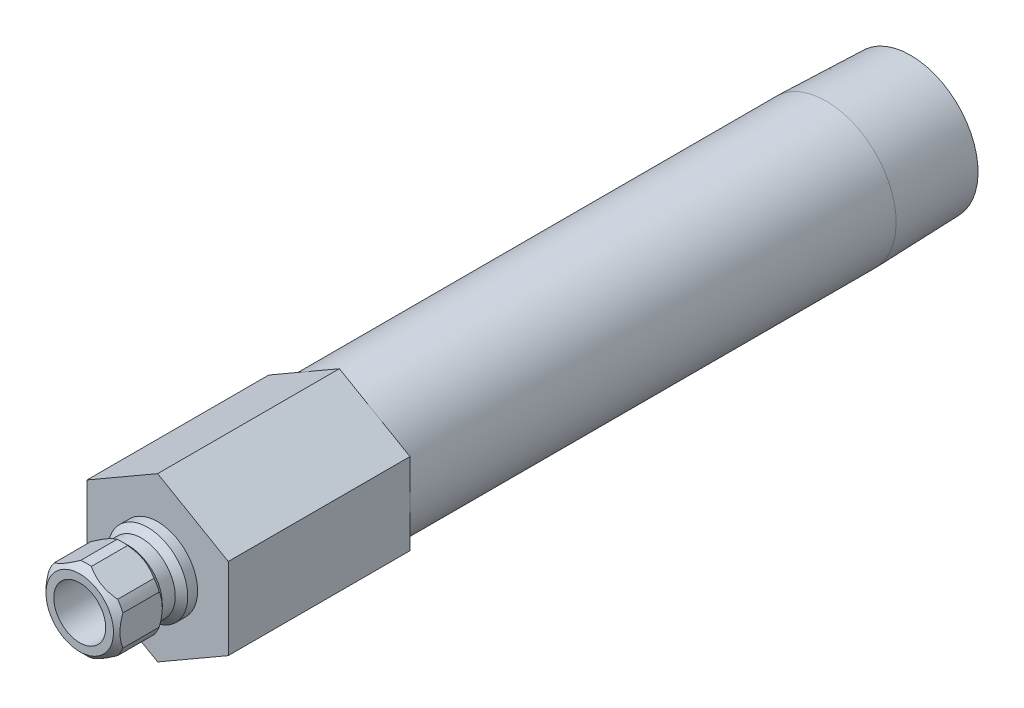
ISO-10303-21;
HEADER;
FILE_DESCRIPTION(('STEP AP214'),'2;1');
FILE_NAME('part.step','',(''),(''),'','','');
FILE_SCHEMA(('AUTOMOTIVE_DESIGN { 1 0 10303 214 1 1 1 1 }'));
ENDSEC;
DATA;
#1=APPLICATION_CONTEXT('core data for automotive mechanical design processes');
#2=APPLICATION_PROTOCOL_DEFINITION('international standard','automotive_design',2000,#1);
#3=PRODUCT_CONTEXT('',#1,'mechanical');
#4=PRODUCT('Part','Part','',(#3));
#5=PRODUCT_RELATED_PRODUCT_CATEGORY('part','',(#4));
#6=PRODUCT_DEFINITION_FORMATION('','',#4);
#7=PRODUCT_DEFINITION_CONTEXT('part definition',#1,'design');
#8=PRODUCT_DEFINITION('design','',#6,#7);
#9=PRODUCT_DEFINITION_SHAPE('','',#8);
#10=(LENGTH_UNIT() NAMED_UNIT(*) SI_UNIT(.MILLI.,.METRE.));
#11=(NAMED_UNIT(*) PLANE_ANGLE_UNIT() SI_UNIT($,.RADIAN.));
#12=(NAMED_UNIT(*) SI_UNIT($,.STERADIAN.) SOLID_ANGLE_UNIT());
#13=UNCERTAINTY_MEASURE_WITH_UNIT(LENGTH_MEASURE(1.E-05),#10,'distance_accuracy_value','');
#14=(GEOMETRIC_REPRESENTATION_CONTEXT(3) GLOBAL_UNCERTAINTY_ASSIGNED_CONTEXT((#13)) GLOBAL_UNIT_ASSIGNED_CONTEXT((#10,
#11,#12)) REPRESENTATION_CONTEXT('',''));
#15=CARTESIAN_POINT('',(0.,0.,0.));
#16=DIRECTION('',(0.,0.,1.));
#17=DIRECTION('',(1.,0.,0.));
#18=AXIS2_PLACEMENT_3D('',#15,#16,#17);
#19=CARTESIAN_POINT('',(0.,0.,0.));
#20=DIRECTION('',(0.,0.,-1.));
#21=DIRECTION('',(0.,1.,0.));
#22=AXIS2_PLACEMENT_3D('',#19,#20,#21);
#23=CYLINDRICAL_SURFACE('',#22,4.8895);
#24=DIRECTION('',(0.,0.,-1.));
#25=VECTOR('',#24,1.);
#26=CARTESIAN_POINT('',(4.5212,1.86170910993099,0.));
#27=LINE('',#26,#25);
#28=CARTESIAN_POINT('',(4.5212,1.86170910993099,4.318));
#29=VERTEX_POINT('',#28);
#30=CARTESIAN_POINT('',(4.5212,1.86170910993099,8.763));
#31=VERTEX_POINT('',#30);
#32=EDGE_CURVE('E404',#29,#31,#27,.F.);
#33=ORIENTED_EDGE('',*,*,#32,.F.);
#34=CARTESIAN_POINT('',(0.,0.,4.318));
#35=DIRECTION('',(0.,0.,-1.));
#36=DIRECTION('',(0.,1.,0.));
#37=AXIS2_PLACEMENT_3D('',#34,#35,#36);
#38=CIRCLE('',#37,4.8895);
#39=CARTESIAN_POINT('',(3.87288738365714,2.98461950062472,4.318));
#40=VERTEX_POINT('',#39);
#41=EDGE_CURVE('E206',#40,#29,#38,.T.);
#42=ORIENTED_EDGE('',*,*,#41,.F.);
#43=DIRECTION('',(0.,0.,-1.));
#44=VECTOR('',#43,1.);
#45=CARTESIAN_POINT('',(3.87288738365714,2.98461950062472,0.));
#46=LINE('',#45,#44);
#47=CARTESIAN_POINT('',(3.87288738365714,2.98461950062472,8.763));
#48=VERTEX_POINT('',#47);
#49=EDGE_CURVE('E392',#48,#40,#46,.T.);
#50=ORIENTED_EDGE('',*,*,#49,.F.);
#51=CARTESIAN_POINT('',(0.,0.,8.763));
#52=DIRECTION('',(0.,0.,-1.));
#53=DIRECTION('',(0.,1.,0.));
#54=AXIS2_PLACEMENT_3D('',#51,#52,#53);
#55=CIRCLE('',#54,4.8895);
#56=EDGE_CURVE('E193',#48,#31,#55,.T.);
#57=ORIENTED_EDGE('',*,*,#56,.T.);
#58=EDGE_LOOP('',(#33,#42,#50,#57));
#59=FACE_BOUND('',#58,.T.);
#60=ADVANCED_FACE('F34',(#59),#23,.T.);
#61=DIRECTION('',(0.,0.,-1.));
#62=VECTOR('',#61,1.);
#63=CARTESIAN_POINT('',(0.648312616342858,4.84632861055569,0.));
#64=LINE('',#63,#62);
#65=CARTESIAN_POINT('',(0.648312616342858,4.84632861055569,4.318));
#66=VERTEX_POINT('',#65);
#67=CARTESIAN_POINT('',(0.648312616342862,4.84632861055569,8.763));
#68=VERTEX_POINT('',#67);
#69=EDGE_CURVE('E311',#66,#68,#64,.F.);
#70=ORIENTED_EDGE('',*,*,#69,.F.);
#71=CARTESIAN_POINT('',(-0.648312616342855,4.84632861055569,4.318));
#72=VERTEX_POINT('',#71);
#73=EDGE_CURVE('E202',#72,#66,#38,.T.);
#74=ORIENTED_EDGE('',*,*,#73,.F.);
#75=DIRECTION('',(0.,0.,-1.));
#76=VECTOR('',#75,1.);
#77=CARTESIAN_POINT('',(-0.648312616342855,4.84632861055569,0.));
#78=LINE('',#77,#76);
#79=CARTESIAN_POINT('',(-0.648312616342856,4.84632861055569,8.763));
#80=VERTEX_POINT('',#79);
#81=EDGE_CURVE('E391',#80,#72,#78,.T.);
#82=ORIENTED_EDGE('',*,*,#81,.F.);
#83=EDGE_CURVE('E196',#80,#68,#55,.T.);
#84=ORIENTED_EDGE('',*,*,#83,.T.);
#85=EDGE_LOOP('',(#70,#74,#82,#84));
#86=FACE_BOUND('',#85,.T.);
#87=ADVANCED_FACE('F345',(#86),#23,.T.);
#88=DIRECTION('',(0.,0.,-1.));
#89=VECTOR('',#88,1.);
#90=CARTESIAN_POINT('',(-3.87288738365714,2.98461950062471,0.));
#91=LINE('',#90,#89);
#92=CARTESIAN_POINT('',(-3.87288738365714,2.98461950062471,4.318));
#93=VERTEX_POINT('',#92);
#94=CARTESIAN_POINT('',(-3.87288738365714,2.98461950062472,8.763));
#95=VERTEX_POINT('',#94);
#96=EDGE_CURVE('E54',#93,#95,#91,.F.);
#97=ORIENTED_EDGE('',*,*,#96,.F.);
#98=CARTESIAN_POINT('',(-4.5212,1.86170910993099,4.318));
#99=VERTEX_POINT('',#98);
#100=EDGE_CURVE('E205',#99,#93,#38,.T.);
#101=ORIENTED_EDGE('',*,*,#100,.F.);
#102=DIRECTION('',(0.,0.,-1.));
#103=VECTOR('',#102,1.);
#104=CARTESIAN_POINT('',(-4.5212,1.86170910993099,0.));
#105=LINE('',#104,#103);
#106=CARTESIAN_POINT('',(-4.5212,1.86170910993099,8.763));
#107=VERTEX_POINT('',#106);
#108=EDGE_CURVE('E378',#107,#99,#105,.T.);
#109=ORIENTED_EDGE('',*,*,#108,.F.);
#110=EDGE_CURVE('E195',#107,#95,#55,.T.);
#111=ORIENTED_EDGE('',*,*,#110,.T.);
#112=EDGE_LOOP('',(#97,#101,#109,#111));
#113=FACE_BOUND('',#112,.T.);
#114=ADVANCED_FACE('F350',(#113),#23,.T.);
#115=DIRECTION('',(0.,0.,-1.));
#116=VECTOR('',#115,1.);
#117=CARTESIAN_POINT('',(-4.5212,-1.86170910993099,0.));
#118=LINE('',#117,#116);
#119=CARTESIAN_POINT('',(-4.5212,-1.86170910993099,4.318));
#120=VERTEX_POINT('',#119);
#121=CARTESIAN_POINT('',(-4.5212,-1.86170910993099,8.763));
#122=VERTEX_POINT('',#121);
#123=EDGE_CURVE('E62',#120,#122,#118,.F.);
#124=ORIENTED_EDGE('',*,*,#123,.F.);
#125=CARTESIAN_POINT('',(-3.87288738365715,-2.98461950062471,4.318));
#126=VERTEX_POINT('',#125);
#127=EDGE_CURVE('E377',#126,#120,#38,.T.);
#128=ORIENTED_EDGE('',*,*,#127,.F.);
#129=DIRECTION('',(0.,0.,-1.));
#130=VECTOR('',#129,1.);
#131=CARTESIAN_POINT('',(-3.87288738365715,-2.98461950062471,0.));
#132=LINE('',#131,#130);
#133=CARTESIAN_POINT('',(-3.87288738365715,-2.98461950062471,8.763));
#134=VERTEX_POINT('',#133);
#135=EDGE_CURVE('E265',#134,#126,#132,.T.);
#136=ORIENTED_EDGE('',*,*,#135,.F.);
#137=EDGE_CURVE('E191',#134,#122,#55,.T.);
#138=ORIENTED_EDGE('',*,*,#137,.T.);
#139=EDGE_LOOP('',(#124,#128,#136,#138));
#140=FACE_BOUND('',#139,.T.);
#141=ADVANCED_FACE('F362',(#140),#23,.T.);
#142=DIRECTION('',(0.,0.,-1.));
#143=VECTOR('',#142,1.);
#144=CARTESIAN_POINT('',(-0.648312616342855,-4.84632861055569,0.));
#145=LINE('',#144,#143);
#146=CARTESIAN_POINT('',(-0.648312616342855,-4.84632861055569,4.318));
#147=VERTEX_POINT('',#146);
#148=CARTESIAN_POINT('',(-0.648312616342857,-4.84632861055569,8.763));
#149=VERTEX_POINT('',#148);
#150=EDGE_CURVE('E394',#147,#149,#145,.F.);
#151=ORIENTED_EDGE('',*,*,#150,.F.);
#152=CARTESIAN_POINT('',(0.648312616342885,-4.84632861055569,4.318));
#153=VERTEX_POINT('',#152);
#154=EDGE_CURVE('E183',#153,#147,#38,.T.);
#155=ORIENTED_EDGE('',*,*,#154,.F.);
#156=DIRECTION('',(0.,0.,-1.));
#157=VECTOR('',#156,1.);
#158=CARTESIAN_POINT('',(0.648312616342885,-4.84632861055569,0.));
#159=LINE('',#158,#157);
#160=CARTESIAN_POINT('',(0.648312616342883,-4.84632861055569,8.763));
#161=VERTEX_POINT('',#160);
#162=EDGE_CURVE('E165',#161,#153,#159,.T.);
#163=ORIENTED_EDGE('',*,*,#162,.F.);
#164=EDGE_CURVE('E181',#161,#149,#55,.T.);
#165=ORIENTED_EDGE('',*,*,#164,.T.);
#166=EDGE_LOOP('',(#151,#155,#163,#165));
#167=FACE_BOUND('',#166,.T.);
#168=ADVANCED_FACE('F180',(#167),#23,.T.);
#169=CARTESIAN_POINT('',(0.,0.,0.));
#170=DIRECTION('',(0.,0.,-1.));
#171=DIRECTION('',(0.,1.,0.));
#172=AXIS2_PLACEMENT_3D('',#169,#170,#171);
#173=CYLINDRICAL_SURFACE('',#172,8.57249999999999);
#174=CARTESIAN_POINT('',(0.,0.,-81.7372));
#175=DIRECTION('',(0.,0.,-1.));
#176=DIRECTION('',(0.,1.,0.));
#177=AXIS2_PLACEMENT_3D('',#174,#175,#176);
#178=CIRCLE('',#177,8.57249999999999);
#179=CARTESIAN_POINT('',(0.,8.5725,-81.7372));
#180=VERTEX_POINT('',#179);
#181=EDGE_CURVE('E219',#180,#180,#178,.T.);
#182=ORIENTED_EDGE('',*,*,#181,.F.);
#183=EDGE_LOOP('',(#182));
#184=FACE_BOUND('',#183,.T.);
#185=CARTESIAN_POINT('',(0.,0.,-22.225));
#186=DIRECTION('',(0.,0.,1.));
#187=DIRECTION('',(1.,0.,0.));
#188=AXIS2_PLACEMENT_3D('',#185,#186,#187);
#189=CIRCLE('',#188,8.57249999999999);
#190=CARTESIAN_POINT('',(8.57249999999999,0.,-22.225));
#191=VERTEX_POINT('',#190);
#192=EDGE_CURVE('E233',#191,#191,#189,.F.);
#193=ORIENTED_EDGE('',*,*,#192,.T.);
#194=EDGE_LOOP('',(#193));
#195=FACE_BOUND('',#194,.T.);
#196=ADVANCED_FACE('F361',(#184,#195),#173,.T.);
#197=CARTESIAN_POINT('',(0.,0.,0.));
#198=DIRECTION('',(0.,0.,-1.));
#199=DIRECTION('',(0.,1.,0.));
#200=AXIS2_PLACEMENT_3D('',#197,#198,#199);
#201=CYLINDRICAL_SURFACE('',#200,3.175);
#202=CARTESIAN_POINT('',(0.,0.,9.525));
#203=DIRECTION('',(0.,0.,-1.));
#204=DIRECTION('',(0.,1.,0.));
#205=AXIS2_PLACEMENT_3D('',#202,#203,#204);
#206=CIRCLE('',#205,3.175);
#207=CARTESIAN_POINT('',(0.,3.175,9.525));
#208=VERTEX_POINT('',#207);
#209=EDGE_CURVE('E235',#208,#208,#206,.T.);
#210=ORIENTED_EDGE('',*,*,#209,.F.);
#211=EDGE_LOOP('',(#210));
#212=FACE_BOUND('',#211,.T.);
#213=CARTESIAN_POINT('',(0.,0.,-22.225));
#214=DIRECTION('',(0.,0.,-1.));
#215=DIRECTION('',(0.,1.,0.));
#216=AXIS2_PLACEMENT_3D('',#213,#214,#215);
#217=CIRCLE('',#216,3.175);
#218=CARTESIAN_POINT('',(0.,3.175,-22.225));
#219=VERTEX_POINT('',#218);
#220=EDGE_CURVE('E174',#219,#219,#217,.T.);
#221=ORIENTED_EDGE('',*,*,#220,.T.);
#222=EDGE_LOOP('',(#221));
#223=FACE_BOUND('',#222,.T.);
#224=ADVANCED_FACE('F36',(#212,#223),#201,.F.);
#225=CARTESIAN_POINT('',(0.,3.175,-22.225));
#226=DIRECTION('',(0.,0.,-1.));
#227=DIRECTION('',(0.,1.,0.));
#228=AXIS2_PLACEMENT_3D('',#225,#226,#227);
#229=PLANE('',#228);
#230=CARTESIAN_POINT('',(0.,0.,-22.225));
#231=DIRECTION('',(0.,0.,-1.));
#232=DIRECTION('',(0.,1.,0.));
#233=AXIS2_PLACEMENT_3D('',#230,#231,#232);
#234=CIRCLE('',#233,6.2611);
#235=CARTESIAN_POINT('',(0.,6.2611,-22.225));
#236=VERTEX_POINT('',#235);
#237=EDGE_CURVE('E228',#236,#236,#234,.T.);
#238=ORIENTED_EDGE('',*,*,#237,.T.);
#239=EDGE_LOOP('',(#238));
#240=FACE_BOUND('',#239,.T.);
#241=ORIENTED_EDGE('',*,*,#220,.F.);
#242=EDGE_LOOP('',(#241));
#243=FACE_BOUND('',#242,.T.);
#244=ADVANCED_FACE('F533',(#240,#243),#229,.T.);
#245=CARTESIAN_POINT('',(0.,0.,0.));
#246=DIRECTION('',(0.,0.,-1.));
#247=DIRECTION('',(0.,1.,0.));
#248=AXIS2_PLACEMENT_3D('',#245,#246,#247);
#249=CYLINDRICAL_SURFACE('',#248,6.26109999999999);
#250=CARTESIAN_POINT('',(0.,0.,-92.075));
#251=DIRECTION('',(0.,0.,-1.));
#252=DIRECTION('',(0.,1.,0.));
#253=AXIS2_PLACEMENT_3D('',#250,#251,#252);
#254=CIRCLE('',#253,6.26109999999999);
#255=CARTESIAN_POINT('',(0.,6.2611,-92.075));
#256=VERTEX_POINT('',#255);
#257=EDGE_CURVE('E225',#256,#256,#254,.T.);
#258=ORIENTED_EDGE('',*,*,#257,.T.);
#259=EDGE_LOOP('',(#258));
#260=FACE_BOUND('',#259,.T.);
#261=ORIENTED_EDGE('',*,*,#237,.F.);
#262=EDGE_LOOP('',(#261));
#263=FACE_BOUND('',#262,.T.);
#264=ADVANCED_FACE('F530',(#260,#263),#249,.F.);
#265=CARTESIAN_POINT('',(0.,8.24944566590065,-92.075));
#266=DIRECTION('',(0.,0.,-1.));
#267=DIRECTION('',(0.,1.,0.));
#268=AXIS2_PLACEMENT_3D('',#265,#266,#267);
#269=PLANE('',#268);
#270=CARTESIAN_POINT('',(0.,0.,-92.075));
#271=DIRECTION('',(0.,0.,-1.));
#272=DIRECTION('',(0.,1.,0.));
#273=AXIS2_PLACEMENT_3D('',#270,#271,#272);
#274=CIRCLE('',#273,8.24944566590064);
#275=CARTESIAN_POINT('',(0.,8.24944566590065,-92.075));
#276=VERTEX_POINT('',#275);
#277=EDGE_CURVE('E222',#276,#276,#274,.T.);
#278=ORIENTED_EDGE('',*,*,#277,.T.);
#279=EDGE_LOOP('',(#278));
#280=FACE_BOUND('',#279,.T.);
#281=ORIENTED_EDGE('',*,*,#257,.F.);
#282=EDGE_LOOP('',(#281));
#283=FACE_BOUND('',#282,.T.);
#284=ADVANCED_FACE('F524',(#280,#283),#269,.T.);
#285=CARTESIAN_POINT('',(0.,0.,-92.075));
#286=DIRECTION('',(0.,0.,1.));
#287=DIRECTION('',(0.,-1.,0.));
#288=AXIS2_PLACEMENT_3D('',#285,#286,#287);
#289=CONICAL_SURFACE('',#288,8.24944566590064,0.0312396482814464);
#290=ORIENTED_EDGE('',*,*,#181,.T.);
#291=EDGE_LOOP('',(#290));
#292=FACE_BOUND('',#291,.T.);
#293=ORIENTED_EDGE('',*,*,#277,.F.);
#294=EDGE_LOOP('',(#293));
#295=FACE_BOUND('',#294,.T.);
#296=ADVANCED_FACE('F514',(#292,#295),#289,.T.);
#297=CARTESIAN_POINT('',(0.,4.8895,0.));
#298=DIRECTION('',(0.,0.,1.));
#299=DIRECTION('',(0.,-1.,0.));
#300=AXIS2_PLACEMENT_3D('',#297,#298,#299);
#301=PLANE('',#300);
#302=CARTESIAN_POINT('',(0.,0.,0.));
#303=DIRECTION('',(0.,0.,-1.));
#304=DIRECTION('',(0.,1.,0.));
#305=AXIS2_PLACEMENT_3D('',#302,#303,#304);
#306=CIRCLE('',#305,4.8895);
#307=CARTESIAN_POINT('',(0.,4.8895,0.));
#308=VERTEX_POINT('',#307);
#309=EDGE_CURVE('E216',#308,#308,#306,.T.);
#310=ORIENTED_EDGE('',*,*,#309,.T.);
#311=EDGE_LOOP('',(#310));
#312=FACE_BOUND('',#311,.T.);
#313=DIRECTION('',(-0.866025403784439,-0.5,0.));
#314=VECTOR('',#313,1.);
#315=CARTESIAN_POINT('',(0.,9.97199384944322,0.));
#316=LINE('',#315,#314);
#317=CARTESIAN_POINT('',(0.,9.97199384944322,0.));
#318=VERTEX_POINT('',#317);
#319=CARTESIAN_POINT('',(-8.636,4.98599692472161,0.));
#320=VERTEX_POINT('',#319);
#321=EDGE_CURVE('E409',#318,#320,#316,.T.);
#322=ORIENTED_EDGE('',*,*,#321,.T.);
#323=DIRECTION('',(0.,-1.,0.));
#324=VECTOR('',#323,1.);
#325=CARTESIAN_POINT('',(-8.636,4.98599692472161,0.));
#326=LINE('',#325,#324);
#327=CARTESIAN_POINT('',(-8.636,-4.98599692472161,0.));
#328=VERTEX_POINT('',#327);
#329=EDGE_CURVE('E436',#320,#328,#326,.T.);
#330=ORIENTED_EDGE('',*,*,#329,.T.);
#331=DIRECTION('',(0.866025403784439,-0.5,0.));
#332=VECTOR('',#331,1.);
#333=CARTESIAN_POINT('',(-8.636,-4.98599692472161,0.));
#334=LINE('',#333,#332);
#335=CARTESIAN_POINT('',(0.,-9.97199384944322,0.));
#336=VERTEX_POINT('',#335);
#337=EDGE_CURVE('E439',#328,#336,#334,.T.);
#338=ORIENTED_EDGE('',*,*,#337,.T.);
#339=DIRECTION('',(0.866025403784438,0.5,0.));
#340=VECTOR('',#339,1.);
#341=CARTESIAN_POINT('',(0.,-9.97199384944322,0.));
#342=LINE('',#341,#340);
#343=CARTESIAN_POINT('',(8.636,-4.98599692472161,0.));
#344=VERTEX_POINT('',#343);
#345=EDGE_CURVE('E442',#336,#344,#342,.T.);
#346=ORIENTED_EDGE('',*,*,#345,.T.);
#347=DIRECTION('',(0.,1.,0.));
#348=VECTOR('',#347,1.);
#349=CARTESIAN_POINT('',(8.636,-4.98599692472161,0.));
#350=LINE('',#349,#348);
#351=CARTESIAN_POINT('',(8.636,4.98599692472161,0.));
#352=VERTEX_POINT('',#351);
#353=EDGE_CURVE('E445',#344,#352,#350,.T.);
#354=ORIENTED_EDGE('',*,*,#353,.T.);
#355=DIRECTION('',(-0.866025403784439,0.5,0.));
#356=VECTOR('',#355,1.);
#357=CARTESIAN_POINT('',(8.636,4.98599692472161,0.));
#358=LINE('',#357,#356);
#359=EDGE_CURVE('E418',#352,#318,#358,.T.);
#360=ORIENTED_EDGE('',*,*,#359,.T.);
#361=EDGE_LOOP('',(#322,#330,#338,#346,#354,#360));
#362=FACE_BOUND('',#361,.T.);
#363=ADVANCED_FACE('F511',(#312,#362),#301,.T.);
#364=CARTESIAN_POINT('',(0.,0.,0.));
#365=DIRECTION('',(0.,0.,-1.));
#366=DIRECTION('',(0.,1.,0.));
#367=AXIS2_PLACEMENT_3D('',#364,#365,#366);
#368=CYLINDRICAL_SURFACE('',#367,4.8895);
#369=CARTESIAN_POINT('',(0.,0.,1.2065));
#370=DIRECTION('',(0.,0.,-1.));
#371=DIRECTION('',(0.,1.,0.));
#372=AXIS2_PLACEMENT_3D('',#369,#370,#371);
#373=CIRCLE('',#372,4.8895);
#374=CARTESIAN_POINT('',(0.,4.8895,1.2065));
#375=VERTEX_POINT('',#374);
#376=EDGE_CURVE('E213',#375,#375,#373,.T.);
#377=ORIENTED_EDGE('',*,*,#376,.T.);
#378=EDGE_LOOP('',(#377));
#379=FACE_BOUND('',#378,.T.);
#380=ORIENTED_EDGE('',*,*,#309,.F.);
#381=EDGE_LOOP('',(#380));
#382=FACE_BOUND('',#381,.T.);
#383=ADVANCED_FACE('F513',(#379,#382),#368,.T.);
#384=CARTESIAN_POINT('',(0.,0.,1.2065));
#385=DIRECTION('',(0.,0.,-1.));
#386=DIRECTION('',(0.,1.,0.));
#387=AXIS2_PLACEMENT_3D('',#384,#385,#386);
#388=CONICAL_SURFACE('',#387,4.8895,0.785398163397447);
#389=CARTESIAN_POINT('',(0.,0.,1.9685));
#390=DIRECTION('',(0.,0.,-1.));
#391=DIRECTION('',(0.,1.,0.));
#392=AXIS2_PLACEMENT_3D('',#389,#390,#391);
#393=CIRCLE('',#392,4.1275);
#394=CARTESIAN_POINT('',(0.,4.1275,1.9685));
#395=VERTEX_POINT('',#394);
#396=EDGE_CURVE('E210',#395,#395,#393,.T.);
#397=ORIENTED_EDGE('',*,*,#396,.T.);
#398=EDGE_LOOP('',(#397));
#399=FACE_BOUND('',#398,.T.);
#400=ORIENTED_EDGE('',*,*,#376,.F.);
#401=EDGE_LOOP('',(#400));
#402=FACE_BOUND('',#401,.T.);
#403=ADVANCED_FACE('F521',(#399,#402),#388,.T.);
#404=CARTESIAN_POINT('',(0.,0.,0.));
#405=DIRECTION('',(0.,0.,-1.));
#406=DIRECTION('',(0.,1.,0.));
#407=AXIS2_PLACEMENT_3D('',#404,#405,#406);
#408=CYLINDRICAL_SURFACE('',#407,4.1275);
#409=CARTESIAN_POINT('',(0.,0.,3.556));
#410=DIRECTION('',(0.,0.,-1.));
#411=DIRECTION('',(0.,1.,0.));
#412=AXIS2_PLACEMENT_3D('',#409,#410,#411);
#413=CIRCLE('',#412,4.1275);
#414=CARTESIAN_POINT('',(0.,4.1275,3.556));
#415=VERTEX_POINT('',#414);
#416=EDGE_CURVE('E207',#415,#415,#413,.T.);
#417=ORIENTED_EDGE('',*,*,#416,.T.);
#418=EDGE_LOOP('',(#417));
#419=FACE_BOUND('',#418,.T.);
#420=ORIENTED_EDGE('',*,*,#396,.F.);
#421=EDGE_LOOP('',(#420));
#422=FACE_BOUND('',#421,.T.);
#423=ADVANCED_FACE('F272',(#419,#422),#408,.T.);
#424=CARTESIAN_POINT('',(0.,0.,3.556));
#425=DIRECTION('',(0.,0.,1.));
#426=DIRECTION('',(0.,-1.,0.));
#427=AXIS2_PLACEMENT_3D('',#424,#425,#426);
#428=CONICAL_SURFACE('',#427,4.1275,0.785398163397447);
#429=CARTESIAN_POINT('',(4.52119999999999,-5.15925306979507,6.28846659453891));
#430=CARTESIAN_POINT('',(4.52119999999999,-5.03341781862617,6.19384981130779));
#431=CARTESIAN_POINT('',(4.52119999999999,-4.90687282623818,6.100161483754));
#432=CARTESIAN_POINT('',(4.52119999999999,-4.65208542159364,5.91505573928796));
#433=CARTESIAN_POINT('',(4.52119999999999,-4.52384258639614,5.8236389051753));
#434=CARTESIAN_POINT('',(4.52119999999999,-4.26444371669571,5.64284060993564));
#435=CARTESIAN_POINT('',(4.52119999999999,-4.1332728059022,5.5534804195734));
#436=CARTESIAN_POINT('',(4.52119999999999,-3.86869655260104,5.37814219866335));
#437=CARTESIAN_POINT('',(4.52119999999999,-3.73529136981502,5.29216392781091));
#438=CARTESIAN_POINT('',(4.52119999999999,-3.45835736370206,5.11964219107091));
#439=CARTESIAN_POINT('',(4.52119999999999,-3.31467977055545,5.03333631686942));
#440=CARTESIAN_POINT('',(4.52119999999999,-3.02397608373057,4.86646929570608));
#441=CARTESIAN_POINT('',(4.52119999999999,-2.87694947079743,4.78590904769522));
#442=CARTESIAN_POINT('',(4.52119999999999,-2.57957206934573,4.6322757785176));
#443=CARTESIAN_POINT('',(4.52119999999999,-2.42923274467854,4.55918074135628));
#444=CARTESIAN_POINT('',(4.52119999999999,-2.12448469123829,4.4221138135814));
#445=CARTESIAN_POINT('',(4.52119999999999,-1.97007782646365,4.35813782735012));
#446=CARTESIAN_POINT('',(4.52119999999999,-1.66898205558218,4.24604782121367));
#447=CARTESIAN_POINT('',(4.52119999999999,-1.52260919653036,4.19709368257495));
#448=CARTESIAN_POINT('',(4.52119999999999,-1.22638031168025,4.11093488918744));
#449=CARTESIAN_POINT('',(4.52119999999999,-1.07652404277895,4.07373105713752));
#450=CARTESIAN_POINT('',(4.52119999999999,-0.776693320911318,4.01362130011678));
#451=CARTESIAN_POINT('',(4.52119999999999,-0.626768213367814,3.99047322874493));
#452=CARTESIAN_POINT('',(4.52119999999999,-0.325366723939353,3.95891692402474));
#453=CARTESIAN_POINT('',(4.52119999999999,-0.173890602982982,3.95050625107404));
#454=CARTESIAN_POINT('',(4.52119999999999,0.123852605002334,3.94903068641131));
#455=CARTESIAN_POINT('',(4.52119999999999,0.270117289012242,3.95544130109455));
#456=CARTESIAN_POINT('',(4.52119999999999,0.561370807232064,3.98210770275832));
#457=CARTESIAN_POINT('',(4.5212,0.706359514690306,4.0023648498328));
#458=CARTESIAN_POINT('',(4.5212,0.996462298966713,4.05597163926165));
#459=CARTESIAN_POINT('',(4.5212,1.14153485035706,4.08954247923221));
#460=CARTESIAN_POINT('',(4.5212,1.42852462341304,4.1680002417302));
#461=CARTESIAN_POINT('',(4.5212,1.57044212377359,4.21288616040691));
#462=CARTESIAN_POINT('',(4.5212,1.86505501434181,4.31714129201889));
#463=CARTESIAN_POINT('',(4.5212,2.01739126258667,4.377515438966));
#464=CARTESIAN_POINT('',(4.5212,2.31809735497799,4.50751823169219));
#465=CARTESIAN_POINT('',(4.5212,2.46646529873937,4.57715121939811));
#466=CARTESIAN_POINT('',(4.5212,2.75996557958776,4.72401353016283));
#467=CARTESIAN_POINT('',(4.5212,2.9050858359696,4.80126680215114));
#468=CARTESIAN_POINT('',(4.5212,3.19198335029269,4.96166050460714));
#469=CARTESIAN_POINT('',(4.5212,3.33376113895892,5.04479999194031));
#470=CARTESIAN_POINT('',(4.5212,3.60742153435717,5.21154136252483));
#471=CARTESIAN_POINT('',(4.5212,3.73944496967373,5.29491333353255));
#472=CARTESIAN_POINT('',(4.5212,4.00122581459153,5.46515273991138));
#473=CARTESIAN_POINT('',(4.5212,4.13098305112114,5.55202044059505));
#474=CARTESIAN_POINT('',(4.5212,4.38747396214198,5.72790624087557));
#475=CARTESIAN_POINT('',(4.5212,4.51422365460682,5.81690106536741));
#476=CARTESIAN_POINT('',(4.5212,4.76599253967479,5.99723636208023));
#477=CARTESIAN_POINT('',(4.5212,4.89101219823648,6.08857618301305));
#478=CARTESIAN_POINT('',(4.5212,5.0153077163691,6.18087446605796));
#479=B_SPLINE_CURVE_WITH_KNOTS('',3,(#429,#430,#431,#432,#433,#434,#435,#436,#437,#438,#439,
#440,#441,#442,#443,#444,#445,#446,#447,#448,#449,#450,#451,#452,#453,#454,#455,#456,#457,#458,
#459,#460,#461,#462,#463,#464,#465,#466,#467,#468,#469,#470,#471,#472,#473,#474,#475,#476,#477,
#478),.UNSPECIFIED.,.F.,.F.,(4,2,2,2,2,2,2,2,2,2,2,2,2,2,2,2,2,2,2,2,2,2,2,2,4),(0.,
0.472324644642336,0.944769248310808,1.42087610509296,1.89694907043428,2.39966187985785,
2.90245317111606,3.40371602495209,3.90475303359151,4.36737130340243,4.83002195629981,
5.28445770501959,5.73881822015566,6.17734710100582,6.61591906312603,7.06210522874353,
7.5082518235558,7.99945943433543,8.49089821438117,8.98393391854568,9.4768908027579,
9.94525924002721,10.4136632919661,10.8782525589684,11.3427141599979),.UNSPECIFIED.);
#480=CARTESIAN_POINT('',(4.52119999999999,-1.861709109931,4.318));
#481=VERTEX_POINT('',#480);
#482=EDGE_CURVE('E407',#481,#29,#479,.T.);
#483=ORIENTED_EDGE('',*,*,#482,.F.);
#484=CARTESIAN_POINT('',(3.87288738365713,-2.98461950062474,4.318));
#485=VERTEX_POINT('',#484);
#486=EDGE_CURVE('E385',#481,#485,#38,.T.);
#487=ORIENTED_EDGE('',*,*,#486,.T.);
#488=CARTESIAN_POINT('',(0.647857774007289,-4.84659121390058,4.3182));
#489=CARTESIAN_POINT('',(0.775261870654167,-4.77303442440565,4.26213711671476));
#490=CARTESIAN_POINT('',(0.904457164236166,-4.69844348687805,4.21102627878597));
#491=CARTESIAN_POINT('',(1.16629518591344,-4.5472712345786,4.1207431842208));
#492=CARTESIAN_POINT('',(1.29894624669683,-4.47068510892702,4.08160338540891));
#493=CARTESIAN_POINT('',(1.56203676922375,-4.31878972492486,4.01877592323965));
#494=CARTESIAN_POINT('',(1.69238331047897,-4.24353411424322,3.99458163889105));
#495=CARTESIAN_POINT('',(1.95434729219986,-4.09228913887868,3.96102228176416));
#496=CARTESIAN_POINT('',(2.08596281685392,-4.01630088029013,3.95163757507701));
#497=CARTESIAN_POINT('',(2.3562305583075,-3.86026172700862,3.94821923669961));
#498=CARTESIAN_POINT('',(2.49489129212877,-3.78020591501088,3.95501290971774));
#499=CARTESIAN_POINT('',(2.7710334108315,-3.62077518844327,3.9851849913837));
#500=CARTESIAN_POINT('',(2.90851272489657,-3.5414014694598,4.00858815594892));
#501=CARTESIAN_POINT('',(3.18622016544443,-3.38106700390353,4.07155129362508));
#502=CARTESIAN_POINT('',(3.32634361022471,-3.30016669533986,4.11171074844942));
#503=CARTESIAN_POINT('',(3.60275664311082,-3.14057955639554,4.20550294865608));
#504=CARTESIAN_POINT('',(3.73905611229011,-3.06188702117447,4.25909654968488));
#505=CARTESIAN_POINT('',(3.87334222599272,-2.98435689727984,4.3182));
#506=B_SPLINE_CURVE_WITH_KNOTS('',3,(#488,#489,#490,#491,#492,#493,#494,#495,#496,#497,#498,
#499,#500,#501,#502,#503,#504,#505),.UNSPECIFIED.,.F.,.F.,(4,2,2,2,2,2,2,2,4),(0.,
0.472469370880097,0.946208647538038,1.40285320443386,1.85889185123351,2.33874707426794,
2.81931901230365,3.31879975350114,3.81684169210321),.UNSPECIFIED.);
#507=EDGE_CURVE('E258',#153,#485,#506,.T.);
#508=ORIENTED_EDGE('',*,*,#507,.F.);
#509=ORIENTED_EDGE('',*,*,#154,.T.);
#510=CARTESIAN_POINT('',(-3.87334222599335,-2.98435689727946,4.31820000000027));
#511=CARTESIAN_POINT('',(-3.74593812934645,-3.05791368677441,4.262137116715));
#512=CARTESIAN_POINT('',(-3.61674283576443,-3.13250462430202,4.21102627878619));
#513=CARTESIAN_POINT('',(-3.35490481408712,-3.2836768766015,4.12074318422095));
#514=CARTESIAN_POINT('',(-3.2222537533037,-3.36026300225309,4.08160338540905));
#515=CARTESIAN_POINT('',(-2.95916323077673,-3.51215838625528,4.01877592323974));
#516=CARTESIAN_POINT('',(-2.82881668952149,-3.58741399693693,3.99458163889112));
#517=CARTESIAN_POINT('',(-2.56685270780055,-3.73865897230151,3.96102228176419));
#518=CARTESIAN_POINT('',(-2.43523718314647,-3.81464723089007,3.95163757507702));
#519=CARTESIAN_POINT('',(-2.16496944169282,-3.97068638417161,3.94821923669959));
#520=CARTESIAN_POINT('',(-2.02630870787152,-4.05074219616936,3.9550129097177));
#521=CARTESIAN_POINT('',(-1.75016658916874,-4.21017292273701,3.98518499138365));
#522=CARTESIAN_POINT('',(-1.61268727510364,-4.2895466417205,4.00858815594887));
#523=CARTESIAN_POINT('',(-1.33497983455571,-4.44988110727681,4.07155129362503));
#524=CARTESIAN_POINT('',(-1.1948563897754,-4.5307814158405,4.11171074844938));
#525=CARTESIAN_POINT('',(-0.918443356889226,-4.69036855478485,4.20550294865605));
#526=CARTESIAN_POINT('',(-0.782143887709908,-4.76906109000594,4.25909654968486));
#527=CARTESIAN_POINT('',(-0.647857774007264,-4.84659121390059,4.3182));
#528=B_SPLINE_CURVE_WITH_KNOTS('',3,(#510,#511,#512,#513,#514,#515,#516,#517,#518,#519,#520,
#521,#522,#523,#524,#525,#526,#527),.UNSPECIFIED.,.F.,.F.,(4,2,2,2,2,2,2,2,4),(0.,
0.472469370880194,0.946208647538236,1.40285320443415,1.85889185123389,2.33874707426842,
2.81931901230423,3.31879975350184,3.81684169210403),.UNSPECIFIED.);
#529=EDGE_CURVE('E281',#126,#147,#528,.T.);
#530=ORIENTED_EDGE('',*,*,#529,.F.);
#531=ORIENTED_EDGE('',*,*,#127,.T.);
#532=CARTESIAN_POINT('',(-4.5212,-5.15925306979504,6.2884665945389));
#533=CARTESIAN_POINT('',(-4.5212,-5.03341781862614,6.19384981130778));
#534=CARTESIAN_POINT('',(-4.5212,-4.90687282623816,6.10016148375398));
#535=CARTESIAN_POINT('',(-4.5212,-4.65208542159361,5.91505573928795));
#536=CARTESIAN_POINT('',(-4.5212,-4.52384258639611,5.82363890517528));
#537=CARTESIAN_POINT('',(-4.5212,-4.26444371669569,5.64284060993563));
#538=CARTESIAN_POINT('',(-4.5212,-4.13327280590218,5.55348041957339));
#539=CARTESIAN_POINT('',(-4.5212,-3.86869655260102,5.37814219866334));
#540=CARTESIAN_POINT('',(-4.5212,-3.735291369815,5.2921639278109));
#541=CARTESIAN_POINT('',(-4.5212,-3.45835736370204,5.1196421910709));
#542=CARTESIAN_POINT('',(-4.5212,-3.31467977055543,5.03333631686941));
#543=CARTESIAN_POINT('',(-4.5212,-3.02397608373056,4.86646929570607));
#544=CARTESIAN_POINT('',(-4.5212,-2.87694947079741,4.78590904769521));
#545=CARTESIAN_POINT('',(-4.5212,-2.57957206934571,4.63227577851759));
#546=CARTESIAN_POINT('',(-4.5212,-2.42923274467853,4.55918074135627));
#547=CARTESIAN_POINT('',(-4.5212,-2.12448469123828,4.4221138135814));
#548=CARTESIAN_POINT('',(-4.5212,-1.97007782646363,4.35813782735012));
#549=CARTESIAN_POINT('',(-4.5212,-1.66898205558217,4.24604782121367));
#550=CARTESIAN_POINT('',(-4.5212,-1.52260919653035,4.19709368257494));
#551=CARTESIAN_POINT('',(-4.5212,-1.22638031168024,4.11093488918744));
#552=CARTESIAN_POINT('',(-4.5212,-1.07652404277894,4.07373105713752));
#553=CARTESIAN_POINT('',(-4.5212,-0.776693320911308,4.01362130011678));
#554=CARTESIAN_POINT('',(-4.5212,-0.626768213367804,3.99047322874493));
#555=CARTESIAN_POINT('',(-4.5212,-0.325366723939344,3.95891692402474));
#556=CARTESIAN_POINT('',(-4.5212,-0.173890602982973,3.95050625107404));
#557=CARTESIAN_POINT('',(-4.5212,0.123852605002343,3.94903068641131));
#558=CARTESIAN_POINT('',(-4.5212,0.270117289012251,3.95544130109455));
#559=CARTESIAN_POINT('',(-4.5212,0.561370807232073,3.98210770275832));
#560=CARTESIAN_POINT('',(-4.5212,0.706359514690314,4.0023648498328));
#561=CARTESIAN_POINT('',(-4.5212,0.996462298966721,4.05597163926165));
#562=CARTESIAN_POINT('',(-4.5212,1.14153485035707,4.08954247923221));
#563=CARTESIAN_POINT('',(-4.5212,1.42852462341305,4.16800024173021));
#564=CARTESIAN_POINT('',(-4.5212,1.5704421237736,4.21288616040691));
#565=CARTESIAN_POINT('',(-4.5212,1.86505501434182,4.31714129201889));
#566=CARTESIAN_POINT('',(-4.5212,2.01739126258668,4.377515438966));
#567=CARTESIAN_POINT('',(-4.5212,2.318097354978,4.50751823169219));
#568=CARTESIAN_POINT('',(-4.5212,2.46646529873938,4.57715121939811));
#569=CARTESIAN_POINT('',(-4.5212,2.75996557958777,4.72401353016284));
#570=CARTESIAN_POINT('',(-4.5212,2.9050858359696,4.80126680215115));
#571=CARTESIAN_POINT('',(-4.5212,3.1919833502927,4.96166050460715));
#572=CARTESIAN_POINT('',(-4.5212,3.33376113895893,5.04479999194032));
#573=CARTESIAN_POINT('',(-4.5212,3.60742153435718,5.21154136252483));
#574=CARTESIAN_POINT('',(-4.5212,3.73944496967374,5.29491333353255));
#575=CARTESIAN_POINT('',(-4.5212,4.00122581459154,5.46515273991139));
#576=CARTESIAN_POINT('',(-4.5212,4.13098305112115,5.55202044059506));
#577=CARTESIAN_POINT('',(-4.5212,4.38747396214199,5.72790624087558));
#578=CARTESIAN_POINT('',(-4.5212,4.51422365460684,5.81690106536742));
#579=CARTESIAN_POINT('',(-4.5212,4.76599253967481,5.99723636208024));
#580=CARTESIAN_POINT('',(-4.5212,4.89101219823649,6.08857618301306));
#581=CARTESIAN_POINT('',(-4.5212,5.01530771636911,6.18087446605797));
#582=B_SPLINE_CURVE_WITH_KNOTS('',3,(#532,#533,#534,#535,#536,#537,#538,#539,#540,#541,#542,
#543,#544,#545,#546,#547,#548,#549,#550,#551,#552,#553,#554,#555,#556,#557,#558,#559,#560,#561,
#562,#563,#564,#565,#566,#567,#568,#569,#570,#571,#572,#573,#574,#575,#576,#577,#578,#579,#580,
#581),.UNSPECIFIED.,.F.,.F.,(4,2,2,2,2,2,2,2,2,2,2,2,2,2,2,2,2,2,2,2,2,2,2,2,4),(0.,
0.472324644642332,0.944769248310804,1.42087610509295,1.89694907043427,2.39966187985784,
2.90245317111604,3.40371602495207,3.90475303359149,4.36737130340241,4.83002195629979,
5.28445770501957,5.73881822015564,6.1773471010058,6.615919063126,7.06210522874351,
7.50825182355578,7.9994594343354,8.49089821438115,8.98393391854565,9.47689080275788,
9.94525924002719,10.4136632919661,10.8782525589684,11.3427141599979),.UNSPECIFIED.);
#583=EDGE_CURVE('E288',#99,#120,#582,.F.);
#584=ORIENTED_EDGE('',*,*,#583,.F.);
#585=ORIENTED_EDGE('',*,*,#100,.T.);
#586=CARTESIAN_POINT('',(-0.647857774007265,4.84659121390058,4.3182));
#587=CARTESIAN_POINT('',(-0.775261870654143,4.77303442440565,4.26213711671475));
#588=CARTESIAN_POINT('',(-0.904457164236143,4.69844348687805,4.21102627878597));
#589=CARTESIAN_POINT('',(-1.16629518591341,4.5472712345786,4.12074318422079));
#590=CARTESIAN_POINT('',(-1.2989462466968,4.47068510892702,4.08160338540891));
#591=CARTESIAN_POINT('',(-1.56203676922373,4.31878972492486,4.01877592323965));
#592=CARTESIAN_POINT('',(-1.69238331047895,4.24353411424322,3.99458163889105));
#593=CARTESIAN_POINT('',(-1.95434729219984,4.09228913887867,3.96102228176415));
#594=CARTESIAN_POINT('',(-2.0859628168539,4.01630088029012,3.95163757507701));
#595=CARTESIAN_POINT('',(-2.35623055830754,3.86026172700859,3.9482192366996));
#596=CARTESIAN_POINT('',(-2.49489129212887,3.78020591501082,3.95501290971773));
#597=CARTESIAN_POINT('',(-2.7710334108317,3.62077518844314,3.98518499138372));
#598=CARTESIAN_POINT('',(-2.90851272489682,3.54140146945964,4.00858815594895));
#599=CARTESIAN_POINT('',(-3.18622016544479,3.38106700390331,4.07155129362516));
#600=CARTESIAN_POINT('',(-3.32634361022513,3.3001666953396,4.11171074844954));
#601=CARTESIAN_POINT('',(-3.60275664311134,3.14057955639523,4.20550294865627));
#602=CARTESIAN_POINT('',(-3.73905611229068,3.06188702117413,4.2590965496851));
#603=CARTESIAN_POINT('',(-3.87334222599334,2.98435689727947,4.31820000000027));
#604=B_SPLINE_CURVE_WITH_KNOTS('',3,(#586,#587,#588,#589,#590,#591,#592,#593,#594,#595,#596,
#597,#598,#599,#600,#601,#602,#603),.UNSPECIFIED.,.F.,.F.,(4,2,2,2,2,2,2,2,4),(0.,
0.472469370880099,0.946208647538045,1.40285320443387,1.85889185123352,2.33874707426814,
2.81931901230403,3.31879975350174,3.81684169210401),.UNSPECIFIED.);
#605=EDGE_CURVE('E295',#72,#93,#604,.T.);
#606=ORIENTED_EDGE('',*,*,#605,.F.);
#607=ORIENTED_EDGE('',*,*,#73,.T.);
#608=CARTESIAN_POINT('',(3.87334222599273,2.98435689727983,4.3182));
#609=CARTESIAN_POINT('',(3.74593812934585,3.05791368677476,4.26213711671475));
#610=CARTESIAN_POINT('',(3.61674283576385,3.13250462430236,4.21102627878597));
#611=CARTESIAN_POINT('',(3.35490481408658,3.28367687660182,4.12074318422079));
#612=CARTESIAN_POINT('',(3.22225375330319,3.3602630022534,4.08160338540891));
#613=CARTESIAN_POINT('',(2.95916323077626,3.51215838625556,4.01877592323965));
#614=CARTESIAN_POINT('',(2.82881668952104,3.58741399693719,3.99458163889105));
#615=CARTESIAN_POINT('',(2.56685270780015,3.73865897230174,3.96102228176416));
#616=CARTESIAN_POINT('',(2.4352371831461,3.81464723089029,3.95163757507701));
#617=CARTESIAN_POINT('',(2.16496944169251,3.97068638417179,3.94821923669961));
#618=CARTESIAN_POINT('',(2.02630870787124,4.05074219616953,3.95501290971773));
#619=CARTESIAN_POINT('',(1.75016658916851,4.21017292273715,3.98518499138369));
#620=CARTESIAN_POINT('',(1.61268727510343,4.28954664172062,4.00858815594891));
#621=CARTESIAN_POINT('',(1.33497983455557,4.44988110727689,4.07155129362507));
#622=CARTESIAN_POINT('',(1.19485638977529,4.53078141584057,4.11171074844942));
#623=CARTESIAN_POINT('',(0.918443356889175,4.69036855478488,4.20550294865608));
#624=CARTESIAN_POINT('',(0.782143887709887,4.76906109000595,4.25909654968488));
#625=CARTESIAN_POINT('',(0.64785777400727,4.84659121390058,4.3182));
#626=B_SPLINE_CURVE_WITH_KNOTS('',3,(#608,#609,#610,#611,#612,#613,#614,#615,#616,#617,#618,
#619,#620,#621,#622,#623,#624,#625),.UNSPECIFIED.,.F.,.F.,(4,2,2,2,2,2,2,2,4),(0.,
0.472469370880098,0.946208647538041,1.40285320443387,1.85889185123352,2.33874707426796,
2.81931901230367,3.31879975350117,3.81684169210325),.UNSPECIFIED.);
#627=EDGE_CURVE('E303',#40,#66,#626,.T.);
#628=ORIENTED_EDGE('',*,*,#627,.F.);
#629=ORIENTED_EDGE('',*,*,#41,.T.);
#630=EDGE_LOOP('',(#483,#487,#508,#509,#530,#531,#584,#585,#606,#607,#628,#629));
#631=FACE_BOUND('',#630,.T.);
#632=ORIENTED_EDGE('',*,*,#416,.F.);
#633=EDGE_LOOP('',(#632));
#634=FACE_BOUND('',#633,.T.);
#635=ADVANCED_FACE('F267',(#631,#634),#428,.T.);
#636=DIRECTION('',(0.,0.,-1.));
#637=VECTOR('',#636,1.);
#638=CARTESIAN_POINT('',(4.52119999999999,-1.861709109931,0.));
#639=LINE('',#638,#637);
#640=CARTESIAN_POINT('',(4.52119999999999,-1.861709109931,8.763));
#641=VERTEX_POINT('',#640);
#642=EDGE_CURVE('E310',#641,#481,#639,.T.);
#643=ORIENTED_EDGE('',*,*,#642,.F.);
#644=CARTESIAN_POINT('',(3.87288738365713,-2.98461950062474,8.763));
#645=VERTEX_POINT('',#644);
#646=EDGE_CURVE('E190',#641,#645,#55,.T.);
#647=ORIENTED_EDGE('',*,*,#646,.T.);
#648=DIRECTION('',(0.,0.,-1.));
#649=VECTOR('',#648,1.);
#650=CARTESIAN_POINT('',(3.87288738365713,-2.98461950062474,0.));
#651=LINE('',#650,#649);
#652=EDGE_CURVE('E168',#485,#645,#651,.F.);
#653=ORIENTED_EDGE('',*,*,#652,.F.);
#654=ORIENTED_EDGE('',*,*,#486,.F.);
#655=EDGE_LOOP('',(#643,#647,#653,#654));
#656=FACE_BOUND('',#655,.T.);
#657=ADVANCED_FACE('F271',(#656),#23,.T.);
#658=CARTESIAN_POINT('',(0.,0.,8.763));
#659=DIRECTION('',(0.,0.,-1.));
#660=DIRECTION('',(0.,1.,0.));
#661=AXIS2_PLACEMENT_3D('',#658,#659,#660);
#662=CONICAL_SURFACE('',#661,4.8895,0.785398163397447);
#663=CARTESIAN_POINT('',(4.52119999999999,-5.15925306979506,6.79253340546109));
#664=CARTESIAN_POINT('',(4.52119999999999,-5.03341781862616,6.88715018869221));
#665=CARTESIAN_POINT('',(4.52119999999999,-4.90687282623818,6.980838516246));
#666=CARTESIAN_POINT('',(4.52119999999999,-4.65208542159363,7.16594426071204));
#667=CARTESIAN_POINT('',(4.52119999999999,-4.52384258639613,7.25736109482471));
#668=CARTESIAN_POINT('',(4.52119999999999,-4.2644437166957,7.43815939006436));
#669=CARTESIAN_POINT('',(4.52119999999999,-4.1332728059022,7.5275195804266));
#670=CARTESIAN_POINT('',(4.52119999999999,-3.86869655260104,7.70285780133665));
#671=CARTESIAN_POINT('',(4.52119999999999,-3.73529136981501,7.78883607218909));
#672=CARTESIAN_POINT('',(4.52119999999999,-3.45835736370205,7.9613578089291));
#673=CARTESIAN_POINT('',(4.52119999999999,-3.31467977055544,8.04766368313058));
#674=CARTESIAN_POINT('',(4.52119999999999,-3.02397608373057,8.21453070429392));
#675=CARTESIAN_POINT('',(4.52119999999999,-2.87694947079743,8.29509095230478));
#676=CARTESIAN_POINT('',(4.52119999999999,-2.57957206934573,8.4487242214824));
#677=CARTESIAN_POINT('',(4.52119999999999,-2.42923274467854,8.52181925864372));
#678=CARTESIAN_POINT('',(4.52119999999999,-2.1244846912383,8.6588861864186));
#679=CARTESIAN_POINT('',(4.52119999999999,-1.97007782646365,8.72286217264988));
#680=CARTESIAN_POINT('',(4.52119999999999,-1.66898205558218,8.83495217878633));
#681=CARTESIAN_POINT('',(4.52119999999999,-1.52260919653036,8.88390631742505));
#682=CARTESIAN_POINT('',(4.52119999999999,-1.22638031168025,8.97006511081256));
#683=CARTESIAN_POINT('',(4.52119999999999,-1.07652404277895,9.00726894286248));
#684=CARTESIAN_POINT('',(4.52119999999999,-0.77669332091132,9.06737869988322));
#685=CARTESIAN_POINT('',(4.52119999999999,-0.626768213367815,9.09052677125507));
#686=CARTESIAN_POINT('',(4.52119999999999,-0.325366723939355,9.12208307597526));
#687=CARTESIAN_POINT('',(4.52119999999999,-0.173890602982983,9.13049374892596));
#688=CARTESIAN_POINT('',(4.52119999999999,0.123852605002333,9.13196931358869));
#689=CARTESIAN_POINT('',(4.52119999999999,0.270117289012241,9.12555869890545));
#690=CARTESIAN_POINT('',(4.52119999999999,0.561370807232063,9.09889229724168));
#691=CARTESIAN_POINT('',(4.5212,0.706359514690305,9.0786351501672));
#692=CARTESIAN_POINT('',(4.5212,0.996462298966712,9.02502836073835));
#693=CARTESIAN_POINT('',(4.5212,1.14153485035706,8.9914575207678));
#694=CARTESIAN_POINT('',(4.5212,1.42852462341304,8.91299975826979));
#695=CARTESIAN_POINT('',(4.5212,1.57044212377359,8.86811383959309));
#696=CARTESIAN_POINT('',(4.5212,1.86505501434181,8.76385870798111));
#697=CARTESIAN_POINT('',(4.5212,2.01739126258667,8.703484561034));
#698=CARTESIAN_POINT('',(4.5212,2.31809735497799,8.57348176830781));
#699=CARTESIAN_POINT('',(4.5212,2.46646529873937,8.50384878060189));
#700=CARTESIAN_POINT('',(4.5212,2.75996557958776,8.35698646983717));
#701=CARTESIAN_POINT('',(4.5212,2.90508583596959,8.27973319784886));
#702=CARTESIAN_POINT('',(4.5212,3.19198335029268,8.11933949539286));
#703=CARTESIAN_POINT('',(4.5212,3.33376113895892,8.03620000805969));
#704=CARTESIAN_POINT('',(4.5212,3.60742153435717,7.86945863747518));
#705=CARTESIAN_POINT('',(4.5212,3.73944496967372,7.78608666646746));
#706=CARTESIAN_POINT('',(4.5212,4.00122581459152,7.61584726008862));
#707=CARTESIAN_POINT('',(4.5212,4.13098305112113,7.52897955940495));
#708=CARTESIAN_POINT('',(4.5212,4.38747396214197,7.35309375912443));
#709=CARTESIAN_POINT('',(4.5212,4.51422365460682,7.2640989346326));
#710=CARTESIAN_POINT('',(4.5212,4.76599253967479,7.08376363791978));
#711=CARTESIAN_POINT('',(4.5212,4.89101219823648,6.99242381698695));
#712=CARTESIAN_POINT('',(4.5212,5.01530771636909,6.90012553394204));
#713=B_SPLINE_CURVE_WITH_KNOTS('',3,(#663,#664,#665,#666,#667,#668,#669,#670,#671,#672,#673,
#674,#675,#676,#677,#678,#679,#680,#681,#682,#683,#684,#685,#686,#687,#688,#689,#690,#691,#692,
#693,#694,#695,#696,#697,#698,#699,#700,#701,#702,#703,#704,#705,#706,#707,#708,#709,#710,#711,
#712),.UNSPECIFIED.,.F.,.F.,(4,2,2,2,2,2,2,2,2,2,2,2,2,2,2,2,2,2,2,2,2,2,2,2,4),(0.,
0.472324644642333,0.944769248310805,1.42087610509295,1.89694907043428,2.39966187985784,
2.90245317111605,3.40371602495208,3.9047530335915,4.36737130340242,4.83002195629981,
5.28445770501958,5.73881822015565,6.17734710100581,6.61591906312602,7.06210522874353,
7.5082518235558,7.99945943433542,8.49089821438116,8.98393391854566,9.47689080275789,
9.9452592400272,10.4136632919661,10.8782525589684,11.3427141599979),.UNSPECIFIED.);
#714=EDGE_CURVE('E12',#31,#641,#713,.F.);
#715=ORIENTED_EDGE('',*,*,#714,.F.);
#716=ORIENTED_EDGE('',*,*,#56,.F.);
#717=CARTESIAN_POINT('',(0.647857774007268,4.84659121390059,8.7628));
#718=CARTESIAN_POINT('',(0.775261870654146,4.77303442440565,8.81886288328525));
#719=CARTESIAN_POINT('',(0.904457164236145,4.69844348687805,8.86997372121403));
#720=CARTESIAN_POINT('',(1.16629518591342,4.5472712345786,8.96025681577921));
#721=CARTESIAN_POINT('',(1.29894624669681,4.47068510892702,8.99939661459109));
#722=CARTESIAN_POINT('',(1.56203676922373,4.31878972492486,9.06222407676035));
#723=CARTESIAN_POINT('',(1.69238331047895,4.24353411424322,9.08641836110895));
#724=CARTESIAN_POINT('',(1.95434729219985,4.09228913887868,9.11997771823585));
#725=CARTESIAN_POINT('',(2.0859628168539,4.01630088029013,9.12936242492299));
#726=CARTESIAN_POINT('',(2.35623055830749,3.86026172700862,9.1327807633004));
#727=CARTESIAN_POINT('',(2.49489129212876,3.78020591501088,9.12598709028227));
#728=CARTESIAN_POINT('',(2.77103341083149,3.62077518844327,9.09581500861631));
#729=CARTESIAN_POINT('',(2.90851272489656,3.54140146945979,9.07241184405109));
#730=CARTESIAN_POINT('',(3.18622016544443,3.38106700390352,9.00944870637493));
#731=CARTESIAN_POINT('',(3.32634361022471,3.30016669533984,8.96928925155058));
#732=CARTESIAN_POINT('',(3.60275664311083,3.14057955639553,8.87549705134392));
#733=CARTESIAN_POINT('',(3.73905611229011,3.06188702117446,8.82190345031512));
#734=CARTESIAN_POINT('',(3.87334222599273,2.98435689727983,8.7628));
#735=B_SPLINE_CURVE_WITH_KNOTS('',3,(#717,#718,#719,#720,#721,#722,#723,#724,#725,#726,#727,
#728,#729,#730,#731,#732,#733,#734),.UNSPECIFIED.,.F.,.F.,(4,2,2,2,2,2,2,2,4),(0.,
0.472469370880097,0.946208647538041,1.40285320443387,1.85889185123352,2.33874707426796,
2.81931901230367,3.31879975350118,3.81684169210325),.UNSPECIFIED.);
#736=EDGE_CURVE('E47',#68,#48,#735,.T.);
#737=ORIENTED_EDGE('',*,*,#736,.F.);
#738=ORIENTED_EDGE('',*,*,#83,.F.);
#739=CARTESIAN_POINT('',(-3.87334222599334,2.98435689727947,8.76279999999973));
#740=CARTESIAN_POINT('',(-3.74593812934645,3.05791368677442,8.81886288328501));
#741=CARTESIAN_POINT('',(-3.61674283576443,3.13250462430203,8.86997372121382));
#742=CARTESIAN_POINT('',(-3.35490481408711,3.28367687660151,8.96025681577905));
#743=CARTESIAN_POINT('',(-3.2222537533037,3.3602630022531,8.99939661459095));
#744=CARTESIAN_POINT('',(-2.95916323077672,3.51215838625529,9.06222407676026));
#745=CARTESIAN_POINT('',(-2.82881668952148,3.58741399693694,9.08641836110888));
#746=CARTESIAN_POINT('',(-2.56685270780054,3.73865897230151,9.11997771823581));
#747=CARTESIAN_POINT('',(-2.43523718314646,3.81464723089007,9.12936242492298));
#748=CARTESIAN_POINT('',(-2.16496944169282,3.97068638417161,9.13278076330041));
#749=CARTESIAN_POINT('',(-2.02630870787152,4.05074219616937,9.12598709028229));
#750=CARTESIAN_POINT('',(-1.75016658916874,4.21017292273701,9.09581500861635));
#751=CARTESIAN_POINT('',(-1.61268727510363,4.2895466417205,9.07241184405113));
#752=CARTESIAN_POINT('',(-1.33497983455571,4.44988110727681,9.00944870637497));
#753=CARTESIAN_POINT('',(-1.1948563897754,4.5307814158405,8.96928925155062));
#754=CARTESIAN_POINT('',(-0.918443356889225,4.69036855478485,8.87549705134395));
#755=CARTESIAN_POINT('',(-0.782143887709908,4.76906109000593,8.82190345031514));
#756=CARTESIAN_POINT('',(-0.647857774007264,4.84659121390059,8.7628));
#757=B_SPLINE_CURVE_WITH_KNOTS('',3,(#739,#740,#741,#742,#743,#744,#745,#746,#747,#748,#749,
#750,#751,#752,#753,#754,#755,#756),.UNSPECIFIED.,.F.,.F.,(4,2,2,2,2,2,2,2,4),(0.,
0.472469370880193,0.946208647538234,1.40285320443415,1.85889185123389,2.33874707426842,
2.81931901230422,3.31879975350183,3.81684169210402),.UNSPECIFIED.);
#758=EDGE_CURVE('E327',#95,#80,#757,.T.);
#759=ORIENTED_EDGE('',*,*,#758,.F.);
#760=ORIENTED_EDGE('',*,*,#110,.F.);
#761=CARTESIAN_POINT('',(-4.5212,-5.15925306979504,6.7925334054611));
#762=CARTESIAN_POINT('',(-4.5212,-5.03341781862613,6.88715018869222));
#763=CARTESIAN_POINT('',(-4.5212,-4.90687282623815,6.98083851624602));
#764=CARTESIAN_POINT('',(-4.5212,-4.65208542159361,7.16594426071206));
#765=CARTESIAN_POINT('',(-4.5212,-4.52384258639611,7.25736109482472));
#766=CARTESIAN_POINT('',(-4.5212,-4.26444371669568,7.43815939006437));
#767=CARTESIAN_POINT('',(-4.5212,-4.13327280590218,7.52751958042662));
#768=CARTESIAN_POINT('',(-4.5212,-3.86869655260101,7.70285780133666));
#769=CARTESIAN_POINT('',(-4.5212,-3.73529136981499,7.7888360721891));
#770=CARTESIAN_POINT('',(-4.5212,-3.45835736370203,7.9613578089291));
#771=CARTESIAN_POINT('',(-4.5212,-3.31467977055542,8.04766368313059));
#772=CARTESIAN_POINT('',(-4.5212,-3.02397608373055,8.21453070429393));
#773=CARTESIAN_POINT('',(-4.5212,-2.87694947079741,8.29509095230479));
#774=CARTESIAN_POINT('',(-4.5212,-2.57957206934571,8.44872422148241));
#775=CARTESIAN_POINT('',(-4.5212,-2.42923274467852,8.52181925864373));
#776=CARTESIAN_POINT('',(-4.5212,-2.12448469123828,8.6588861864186));
#777=CARTESIAN_POINT('',(-4.5212,-1.97007782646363,8.72286217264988));
#778=CARTESIAN_POINT('',(-4.5212,-1.66898205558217,8.83495217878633));
#779=CARTESIAN_POINT('',(-4.5212,-1.52260919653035,8.88390631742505));
#780=CARTESIAN_POINT('',(-4.5212,-1.22638031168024,8.97006511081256));
#781=CARTESIAN_POINT('',(-4.5212,-1.07652404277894,9.00726894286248));
#782=CARTESIAN_POINT('',(-4.5212,-0.776693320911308,9.06737869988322));
#783=CARTESIAN_POINT('',(-4.5212,-0.626768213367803,9.09052677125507));
#784=CARTESIAN_POINT('',(-4.5212,-0.325366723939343,9.12208307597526));
#785=CARTESIAN_POINT('',(-4.5212,-0.173890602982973,9.13049374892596));
#786=CARTESIAN_POINT('',(-4.5212,0.123852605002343,9.13196931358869));
#787=CARTESIAN_POINT('',(-4.5212,0.27011728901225,9.12555869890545));
#788=CARTESIAN_POINT('',(-4.5212,0.561370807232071,9.09889229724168));
#789=CARTESIAN_POINT('',(-4.5212,0.706359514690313,9.0786351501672));
#790=CARTESIAN_POINT('',(-4.5212,0.99646229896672,9.02502836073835));
#791=CARTESIAN_POINT('',(-4.5212,1.14153485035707,8.99145752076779));
#792=CARTESIAN_POINT('',(-4.5212,1.42852462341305,8.91299975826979));
#793=CARTESIAN_POINT('',(-4.5212,1.5704421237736,8.86811383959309));
#794=CARTESIAN_POINT('',(-4.5212,1.86505501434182,8.76385870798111));
#795=CARTESIAN_POINT('',(-4.5212,2.01739126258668,8.703484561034));
#796=CARTESIAN_POINT('',(-4.5212,2.318097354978,8.57348176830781));
#797=CARTESIAN_POINT('',(-4.5212,2.46646529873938,8.50384878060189));
#798=CARTESIAN_POINT('',(-4.5212,2.75996557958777,8.35698646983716));
#799=CARTESIAN_POINT('',(-4.5212,2.90508583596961,8.27973319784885));
#800=CARTESIAN_POINT('',(-4.5212,3.1919833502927,8.11933949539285));
#801=CARTESIAN_POINT('',(-4.5212,3.33376113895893,8.03620000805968));
#802=CARTESIAN_POINT('',(-4.5212,3.60742153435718,7.86945863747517));
#803=CARTESIAN_POINT('',(-4.5212,3.73944496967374,7.78608666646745));
#804=CARTESIAN_POINT('',(-4.5212,4.00122581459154,7.61584726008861));
#805=CARTESIAN_POINT('',(-4.5212,4.13098305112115,7.52897955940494));
#806=CARTESIAN_POINT('',(-4.5212,4.38747396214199,7.35309375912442));
#807=CARTESIAN_POINT('',(-4.5212,4.51422365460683,7.26409893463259));
#808=CARTESIAN_POINT('',(-4.5212,4.7659925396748,7.08376363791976));
#809=CARTESIAN_POINT('',(-4.5212,4.89101219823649,6.99242381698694));
#810=CARTESIAN_POINT('',(-4.5212,5.01530771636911,6.90012553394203));
#811=B_SPLINE_CURVE_WITH_KNOTS('',3,(#761,#762,#763,#764,#765,#766,#767,#768,#769,#770,#771,
#772,#773,#774,#775,#776,#777,#778,#779,#780,#781,#782,#783,#784,#785,#786,#787,#788,#789,#790,
#791,#792,#793,#794,#795,#796,#797,#798,#799,#800,#801,#802,#803,#804,#805,#806,#807,#808,#809,
#810),.UNSPECIFIED.,.F.,.F.,(4,2,2,2,2,2,2,2,2,2,2,2,2,2,2,2,2,2,2,2,2,2,2,2,4),(0.,
0.472324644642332,0.944769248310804,1.42087610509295,1.89694907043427,2.39966187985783,
2.90245317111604,3.40371602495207,3.90475303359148,4.3673713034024,4.83002195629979,
5.28445770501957,5.73881822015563,6.17734710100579,6.61591906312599,7.0621052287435,
7.50825182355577,7.9994594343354,8.49089821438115,8.98393391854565,9.47689080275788,
9.94525924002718,10.4136632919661,10.8782525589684,11.3427141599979),.UNSPECIFIED.);
#812=EDGE_CURVE('E331',#122,#107,#811,.T.);
#813=ORIENTED_EDGE('',*,*,#812,.F.);
#814=ORIENTED_EDGE('',*,*,#137,.F.);
#815=CARTESIAN_POINT('',(-0.647857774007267,-4.84659121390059,8.7628));
#816=CARTESIAN_POINT('',(-0.775261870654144,-4.77303442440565,8.81886288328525));
#817=CARTESIAN_POINT('',(-0.904457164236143,-4.69844348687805,8.86997372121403));
#818=CARTESIAN_POINT('',(-1.16629518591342,-4.5472712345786,8.96025681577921));
#819=CARTESIAN_POINT('',(-1.29894624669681,-4.47068510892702,8.99939661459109));
#820=CARTESIAN_POINT('',(-1.56203676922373,-4.31878972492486,9.06222407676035));
#821=CARTESIAN_POINT('',(-1.69238331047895,-4.24353411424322,9.08641836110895));
#822=CARTESIAN_POINT('',(-1.95434729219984,-4.09228913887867,9.11997771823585));
#823=CARTESIAN_POINT('',(-2.0859628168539,-4.01630088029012,9.12936242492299));
#824=CARTESIAN_POINT('',(-2.35623055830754,-3.86026172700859,9.1327807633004));
#825=CARTESIAN_POINT('',(-2.49489129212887,-3.78020591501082,9.12598709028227));
#826=CARTESIAN_POINT('',(-2.7710334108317,-3.62077518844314,9.09581500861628));
#827=CARTESIAN_POINT('',(-2.90851272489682,-3.54140146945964,9.07241184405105));
#828=CARTESIAN_POINT('',(-3.18622016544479,-3.3810670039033,9.00944870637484));
#829=CARTESIAN_POINT('',(-3.32634361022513,-3.3001666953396,8.96928925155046));
#830=CARTESIAN_POINT('',(-3.60275664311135,-3.14057955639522,8.87549705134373));
#831=CARTESIAN_POINT('',(-3.73905611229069,-3.06188702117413,8.8219034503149));
#832=CARTESIAN_POINT('',(-3.87334222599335,-2.98435689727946,8.76279999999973));
#833=B_SPLINE_CURVE_WITH_KNOTS('',3,(#815,#816,#817,#818,#819,#820,#821,#822,#823,#824,#825,
#826,#827,#828,#829,#830,#831,#832),.UNSPECIFIED.,.F.,.F.,(4,2,2,2,2,2,2,2,4),(0.,
0.472469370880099,0.946208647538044,1.40285320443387,1.85889185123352,2.33874707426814,
2.81931901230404,3.31879975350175,3.81684169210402),.UNSPECIFIED.);
#834=EDGE_CURVE('E173',#149,#134,#833,.T.);
#835=ORIENTED_EDGE('',*,*,#834,.F.);
#836=ORIENTED_EDGE('',*,*,#164,.F.);
#837=CARTESIAN_POINT('',(3.87334222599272,-2.98435689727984,8.7628));
#838=CARTESIAN_POINT('',(3.74593812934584,-3.05791368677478,8.81886288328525));
#839=CARTESIAN_POINT('',(3.61674283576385,-3.13250462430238,8.86997372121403));
#840=CARTESIAN_POINT('',(3.35490481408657,-3.28367687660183,8.9602568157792));
#841=CARTESIAN_POINT('',(3.22225375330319,-3.36026300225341,8.99939661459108));
#842=CARTESIAN_POINT('',(2.95916323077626,-3.51215838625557,9.06222407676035));
#843=CARTESIAN_POINT('',(2.82881668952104,-3.5874139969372,9.08641836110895));
#844=CARTESIAN_POINT('',(2.56685270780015,-3.73865897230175,9.11997771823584));
#845=CARTESIAN_POINT('',(2.4352371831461,-3.8146472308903,9.12936242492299));
#846=CARTESIAN_POINT('',(2.16496944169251,-3.9706863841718,9.13278076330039));
#847=CARTESIAN_POINT('',(2.02630870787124,-4.05074219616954,9.12598709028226));
#848=CARTESIAN_POINT('',(1.75016658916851,-4.21017292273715,9.0958150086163));
#849=CARTESIAN_POINT('',(1.61268727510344,-4.28954664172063,9.07241184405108));
#850=CARTESIAN_POINT('',(1.33497983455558,-4.4498811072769,9.00944870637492));
#851=CARTESIAN_POINT('',(1.1948563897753,-4.53078141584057,8.96928925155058));
#852=CARTESIAN_POINT('',(0.918443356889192,-4.69036855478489,8.87549705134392));
#853=CARTESIAN_POINT('',(0.782143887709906,-4.76906109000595,8.82190345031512));
#854=CARTESIAN_POINT('',(0.647857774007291,-4.84659121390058,8.7628));
#855=B_SPLINE_CURVE_WITH_KNOTS('',3,(#837,#838,#839,#840,#841,#842,#843,#844,#845,#846,#847,
#848,#849,#850,#851,#852,#853,#854),.UNSPECIFIED.,.F.,.F.,(4,2,2,2,2,2,2,2,4),(0.,
0.472469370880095,0.946208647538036,1.40285320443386,1.85889185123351,2.33874707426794,
2.81931901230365,3.31879975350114,3.81684169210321),.UNSPECIFIED.);
#856=EDGE_CURVE('E162',#645,#161,#855,.T.);
#857=ORIENTED_EDGE('',*,*,#856,.F.);
#858=ORIENTED_EDGE('',*,*,#646,.F.);
#859=EDGE_LOOP('',(#715,#716,#737,#738,#759,#760,#813,#814,#835,#836,#857,#858));
#860=FACE_BOUND('',#859,.T.);
#861=CARTESIAN_POINT('',(0.,0.,9.525));
#862=DIRECTION('',(0.,0.,-1.));
#863=DIRECTION('',(0.,1.,0.));
#864=AXIS2_PLACEMENT_3D('',#861,#862,#863);
#865=CIRCLE('',#864,4.1275);
#866=CARTESIAN_POINT('',(0.,4.1275,9.525));
#867=VERTEX_POINT('',#866);
#868=EDGE_CURVE('E200',#867,#867,#865,.T.);
#869=ORIENTED_EDGE('',*,*,#868,.T.);
#870=EDGE_LOOP('',(#869));
#871=FACE_BOUND('',#870,.T.);
#872=ADVANCED_FACE('F187',(#860,#871),#662,.T.);
#873=CARTESIAN_POINT('',(0.,3.175,9.525));
#874=DIRECTION('',(0.,0.,1.));
#875=DIRECTION('',(0.,-1.,0.));
#876=AXIS2_PLACEMENT_3D('',#873,#874,#875);
#877=PLANE('',#876);
#878=ORIENTED_EDGE('',*,*,#209,.T.);
#879=EDGE_LOOP('',(#878));
#880=FACE_BOUND('',#879,.T.);
#881=ORIENTED_EDGE('',*,*,#868,.F.);
#882=EDGE_LOOP('',(#881));
#883=FACE_BOUND('',#882,.T.);
#884=ADVANCED_FACE('F358',(#880,#883),#877,.T.);
#885=CARTESIAN_POINT('',(0.,9.97199384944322,-22.225));
#886=DIRECTION('',(-0.5,0.866025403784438,0.));
#887=DIRECTION('',(-0.866025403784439,-0.5,0.));
#888=AXIS2_PLACEMENT_3D('',#885,#886,#887);
#889=PLANE('',#888);
#890=ORIENTED_EDGE('',*,*,#321,.F.);
#891=DIRECTION('',(0.,0.,1.));
#892=VECTOR('',#891,1.);
#893=CARTESIAN_POINT('',(0.,9.97199384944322,-22.225));
#894=LINE('',#893,#892);
#895=CARTESIAN_POINT('',(0.,9.97199384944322,-22.225));
#896=VERTEX_POINT('',#895);
#897=EDGE_CURVE('E236',#896,#318,#894,.T.);
#898=ORIENTED_EDGE('',*,*,#897,.F.);
#899=DIRECTION('',(-0.866025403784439,-0.5,0.));
#900=VECTOR('',#899,1.);
#901=CARTESIAN_POINT('',(0.,9.97199384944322,-22.225));
#902=LINE('',#901,#900);
#903=CARTESIAN_POINT('',(-8.636,4.98599692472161,-22.225));
#904=VERTEX_POINT('',#903);
#905=EDGE_CURVE('E414',#896,#904,#902,.T.);
#906=ORIENTED_EDGE('',*,*,#905,.T.);
#907=DIRECTION('',(0.,0.,1.));
#908=VECTOR('',#907,1.);
#909=CARTESIAN_POINT('',(-8.636,4.98599692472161,-22.225));
#910=LINE('',#909,#908);
#911=EDGE_CURVE('E433',#904,#320,#910,.T.);
#912=ORIENTED_EDGE('',*,*,#911,.T.);
#913=EDGE_LOOP('',(#890,#898,#906,#912));
#914=FACE_BOUND('',#913,.T.);
#915=ADVANCED_FACE('F466',(#914),#889,.T.);
#916=CARTESIAN_POINT('',(8.636,4.98599692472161,-22.225));
#917=DIRECTION('',(0.5,0.866025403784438,0.));
#918=DIRECTION('',(-0.866025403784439,0.5,0.));
#919=AXIS2_PLACEMENT_3D('',#916,#917,#918);
#920=PLANE('',#919);
#921=ORIENTED_EDGE('',*,*,#359,.F.);
#922=DIRECTION('',(0.,0.,1.));
#923=VECTOR('',#922,1.);
#924=CARTESIAN_POINT('',(8.636,4.98599692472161,-22.225));
#925=LINE('',#924,#923);
#926=CARTESIAN_POINT('',(8.636,4.98599692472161,-22.225));
#927=VERTEX_POINT('',#926);
#928=EDGE_CURVE('E451',#927,#352,#925,.T.);
#929=ORIENTED_EDGE('',*,*,#928,.F.);
#930=DIRECTION('',(-0.866025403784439,0.5,0.));
#931=VECTOR('',#930,1.);
#932=CARTESIAN_POINT('',(8.636,4.98599692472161,-22.225));
#933=LINE('',#932,#931);
#934=EDGE_CURVE('E430',#927,#896,#933,.T.);
#935=ORIENTED_EDGE('',*,*,#934,.T.);
#936=ORIENTED_EDGE('',*,*,#897,.T.);
#937=EDGE_LOOP('',(#921,#929,#935,#936));
#938=FACE_BOUND('',#937,.T.);
#939=ADVANCED_FACE('F470',(#938),#920,.T.);
#940=CARTESIAN_POINT('',(8.636,-4.98599692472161,-22.225));
#941=DIRECTION('',(1.,0.,0.));
#942=DIRECTION('',(0.,1.,0.));
#943=AXIS2_PLACEMENT_3D('',#940,#941,#942);
#944=PLANE('',#943);
#945=ORIENTED_EDGE('',*,*,#353,.F.);
#946=DIRECTION('',(0.,0.,1.));
#947=VECTOR('',#946,1.);
#948=CARTESIAN_POINT('',(8.636,-4.98599692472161,-22.225));
#949=LINE('',#948,#947);
#950=CARTESIAN_POINT('',(8.636,-4.98599692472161,-22.225));
#951=VERTEX_POINT('',#950);
#952=EDGE_CURVE('E453',#951,#344,#949,.T.);
#953=ORIENTED_EDGE('',*,*,#952,.F.);
#954=DIRECTION('',(0.,1.,0.));
#955=VECTOR('',#954,1.);
#956=CARTESIAN_POINT('',(8.636,-4.98599692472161,-22.225));
#957=LINE('',#956,#955);
#958=EDGE_CURVE('E427',#951,#927,#957,.T.);
#959=ORIENTED_EDGE('',*,*,#958,.T.);
#960=ORIENTED_EDGE('',*,*,#928,.T.);
#961=EDGE_LOOP('',(#945,#953,#959,#960));
#962=FACE_BOUND('',#961,.T.);
#963=ADVANCED_FACE('F485',(#962),#944,.T.);
#964=CARTESIAN_POINT('',(0.,-9.97199384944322,-22.225));
#965=DIRECTION('',(0.5,-0.866025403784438,0.));
#966=DIRECTION('',(0.866025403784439,0.5,0.));
#967=AXIS2_PLACEMENT_3D('',#964,#965,#966);
#968=PLANE('',#967);
#969=ORIENTED_EDGE('',*,*,#345,.F.);
#970=DIRECTION('',(0.,0.,1.));
#971=VECTOR('',#970,1.);
#972=CARTESIAN_POINT('',(0.,-9.97199384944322,-22.225));
#973=LINE('',#972,#971);
#974=CARTESIAN_POINT('',(0.,-9.97199384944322,-22.225));
#975=VERTEX_POINT('',#974);
#976=EDGE_CURVE('E455',#975,#336,#973,.T.);
#977=ORIENTED_EDGE('',*,*,#976,.F.);
#978=DIRECTION('',(0.866025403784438,0.5,0.));
#979=VECTOR('',#978,1.);
#980=CARTESIAN_POINT('',(0.,-9.97199384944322,-22.225));
#981=LINE('',#980,#979);
#982=EDGE_CURVE('E424',#975,#951,#981,.T.);
#983=ORIENTED_EDGE('',*,*,#982,.T.);
#984=ORIENTED_EDGE('',*,*,#952,.T.);
#985=EDGE_LOOP('',(#969,#977,#983,#984));
#986=FACE_BOUND('',#985,.T.);
#987=ADVANCED_FACE('F481',(#986),#968,.T.);
#988=CARTESIAN_POINT('',(-8.636,-4.98599692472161,-22.225));
#989=DIRECTION('',(-0.5,-0.866025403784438,0.));
#990=DIRECTION('',(0.866025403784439,-0.5,0.));
#991=AXIS2_PLACEMENT_3D('',#988,#989,#990);
#992=PLANE('',#991);
#993=ORIENTED_EDGE('',*,*,#337,.F.);
#994=DIRECTION('',(0.,0.,1.));
#995=VECTOR('',#994,1.);
#996=CARTESIAN_POINT('',(-8.636,-4.98599692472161,-22.225));
#997=LINE('',#996,#995);
#998=CARTESIAN_POINT('',(-8.636,-4.98599692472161,-22.225));
#999=VERTEX_POINT('',#998);
#1000=EDGE_CURVE('E457',#999,#328,#997,.T.);
#1001=ORIENTED_EDGE('',*,*,#1000,.F.);
#1002=DIRECTION('',(0.866025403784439,-0.5,0.));
#1003=VECTOR('',#1002,1.);
#1004=CARTESIAN_POINT('',(-8.636,-4.98599692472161,-22.225));
#1005=LINE('',#1004,#1003);
#1006=EDGE_CURVE('E421',#999,#975,#1005,.T.);
#1007=ORIENTED_EDGE('',*,*,#1006,.T.);
#1008=ORIENTED_EDGE('',*,*,#976,.T.);
#1009=EDGE_LOOP('',(#993,#1001,#1007,#1008));
#1010=FACE_BOUND('',#1009,.T.);
#1011=ADVANCED_FACE('F477',(#1010),#992,.T.);
#1012=CARTESIAN_POINT('',(-8.636,4.98599692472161,-22.225));
#1013=DIRECTION('',(-1.,0.,0.));
#1014=DIRECTION('',(0.,0.,1.));
#1015=AXIS2_PLACEMENT_3D('',#1012,#1013,#1014);
#1016=PLANE('',#1015);
#1017=ORIENTED_EDGE('',*,*,#329,.F.);
#1018=ORIENTED_EDGE('',*,*,#911,.F.);
#1019=DIRECTION('',(0.,-1.,0.));
#1020=VECTOR('',#1019,1.);
#1021=CARTESIAN_POINT('',(-8.636,4.98599692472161,-22.225));
#1022=LINE('',#1021,#1020);
#1023=EDGE_CURVE('E417',#904,#999,#1022,.T.);
#1024=ORIENTED_EDGE('',*,*,#1023,.T.);
#1025=ORIENTED_EDGE('',*,*,#1000,.T.);
#1026=EDGE_LOOP('',(#1017,#1018,#1024,#1025));
#1027=FACE_BOUND('',#1026,.T.);
#1028=ADVANCED_FACE('F474',(#1027),#1016,.T.);
#1029=CARTESIAN_POINT('',(-8.636,4.98599692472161,-22.225));
#1030=DIRECTION('',(0.,0.,1.));
#1031=DIRECTION('',(1.,0.,0.));
#1032=AXIS2_PLACEMENT_3D('',#1029,#1030,#1031);
#1033=PLANE('',#1032);
#1034=ORIENTED_EDGE('',*,*,#192,.F.);
#1035=EDGE_LOOP('',(#1034));
#1036=FACE_BOUND('',#1035,.T.);
#1037=ORIENTED_EDGE('',*,*,#905,.F.);
#1038=ORIENTED_EDGE('',*,*,#934,.F.);
#1039=ORIENTED_EDGE('',*,*,#958,.F.);
#1040=ORIENTED_EDGE('',*,*,#982,.F.);
#1041=ORIENTED_EDGE('',*,*,#1006,.F.);
#1042=ORIENTED_EDGE('',*,*,#1023,.F.);
#1043=EDGE_LOOP('',(#1037,#1038,#1039,#1040,#1041,#1042));
#1044=FACE_BOUND('',#1043,.T.);
#1045=ADVANCED_FACE('F253',(#1036,#1044),#1033,.F.);
#1046=CARTESIAN_POINT('',(0.,-5.22063207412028,9.525));
#1047=DIRECTION('',(-0.5,0.866025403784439,0.));
#1048=DIRECTION('',(-0.866025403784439,-0.5,0.));
#1049=AXIS2_PLACEMENT_3D('',#1046,#1047,#1048);
#1050=PLANE('',#1049);
#1051=ORIENTED_EDGE('',*,*,#507,.T.);
#1052=ORIENTED_EDGE('',*,*,#652,.T.);
#1053=ORIENTED_EDGE('',*,*,#856,.T.);
#1054=ORIENTED_EDGE('',*,*,#162,.T.);
#1055=EDGE_LOOP('',(#1051,#1052,#1053,#1054));
#1056=FACE_BOUND('',#1055,.T.);
#1057=ADVANCED_FACE('F164',(#1056),#1050,.F.);
#1058=CARTESIAN_POINT('',(-4.5212,-2.61031603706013,9.525));
#1059=DIRECTION('',(0.500000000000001,0.866025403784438,0.));
#1060=DIRECTION('',(-0.866025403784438,0.500000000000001,0.));
#1061=AXIS2_PLACEMENT_3D('',#1058,#1059,#1060);
#1062=PLANE('',#1061);
#1063=ORIENTED_EDGE('',*,*,#529,.T.);
#1064=ORIENTED_EDGE('',*,*,#150,.T.);
#1065=ORIENTED_EDGE('',*,*,#834,.T.);
#1066=ORIENTED_EDGE('',*,*,#135,.T.);
#1067=EDGE_LOOP('',(#1063,#1064,#1065,#1066));
#1068=FACE_BOUND('',#1067,.T.);
#1069=ADVANCED_FACE('F252',(#1068),#1062,.F.);
#1070=CARTESIAN_POINT('',(-4.5212,2.61031603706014,9.525));
#1071=DIRECTION('',(1.,0.,0.));
#1072=DIRECTION('',(0.,0.,-1.));
#1073=AXIS2_PLACEMENT_3D('',#1070,#1071,#1072);
#1074=PLANE('',#1073);
#1075=ORIENTED_EDGE('',*,*,#583,.T.);
#1076=ORIENTED_EDGE('',*,*,#123,.T.);
#1077=ORIENTED_EDGE('',*,*,#812,.T.);
#1078=ORIENTED_EDGE('',*,*,#108,.T.);
#1079=EDGE_LOOP('',(#1075,#1076,#1077,#1078));
#1080=FACE_BOUND('',#1079,.T.);
#1081=ADVANCED_FACE('F335',(#1080),#1074,.F.);
#1082=CARTESIAN_POINT('',(0.,5.22063207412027,9.525));
#1083=DIRECTION('',(0.5,-0.866025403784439,0.));
#1084=DIRECTION('',(0.866025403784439,0.5,0.));
#1085=AXIS2_PLACEMENT_3D('',#1082,#1083,#1084);
#1086=PLANE('',#1085);
#1087=ORIENTED_EDGE('',*,*,#605,.T.);
#1088=ORIENTED_EDGE('',*,*,#96,.T.);
#1089=ORIENTED_EDGE('',*,*,#758,.T.);
#1090=ORIENTED_EDGE('',*,*,#81,.T.);
#1091=EDGE_LOOP('',(#1087,#1088,#1089,#1090));
#1092=FACE_BOUND('',#1091,.T.);
#1093=ADVANCED_FACE('F317',(#1092),#1086,.F.);
#1094=CARTESIAN_POINT('',(4.5212,2.61031603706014,9.525));
#1095=DIRECTION('',(-0.5,-0.866025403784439,0.));
#1096=DIRECTION('',(0.866025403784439,-0.5,0.));
#1097=AXIS2_PLACEMENT_3D('',#1094,#1095,#1096);
#1098=PLANE('',#1097);
#1099=ORIENTED_EDGE('',*,*,#627,.T.);
#1100=ORIENTED_EDGE('',*,*,#69,.T.);
#1101=ORIENTED_EDGE('',*,*,#736,.T.);
#1102=ORIENTED_EDGE('',*,*,#49,.T.);
#1103=EDGE_LOOP('',(#1099,#1100,#1101,#1102));
#1104=FACE_BOUND('',#1103,.T.);
#1105=ADVANCED_FACE('F313',(#1104),#1098,.F.);
#1106=CARTESIAN_POINT('',(4.52119999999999,-2.61031603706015,9.525));
#1107=DIRECTION('',(-1.,0.,0.));
#1108=DIRECTION('',(0.,-1.,0.));
#1109=AXIS2_PLACEMENT_3D('',#1106,#1107,#1108);
#1110=PLANE('',#1109);
#1111=ORIENTED_EDGE('',*,*,#482,.T.);
#1112=ORIENTED_EDGE('',*,*,#32,.T.);
#1113=ORIENTED_EDGE('',*,*,#714,.T.);
#1114=ORIENTED_EDGE('',*,*,#642,.T.);
#1115=EDGE_LOOP('',(#1111,#1112,#1113,#1114));
#1116=FACE_BOUND('',#1115,.T.);
#1117=ADVANCED_FACE('F316',(#1116),#1110,.F.);
#1118=CLOSED_SHELL('',(#60,#87,#114,#141,#168,#196,#224,#244,#264,#284,#296,#363,#383,#403,#423,
#635,#657,#872,#884,#915,#939,#963,#987,#1011,#1028,#1045,#1057,#1069,#1081,#1093,#1105,#1117));
#1119=MANIFOLD_SOLID_BREP('B2',#1118);
#1120=ADVANCED_BREP_SHAPE_REPRESENTATION('',(#18,#1119),#14);
#1121=SHAPE_DEFINITION_REPRESENTATION(#9,#1120);
ENDSEC;
END-ISO-10303-21;
